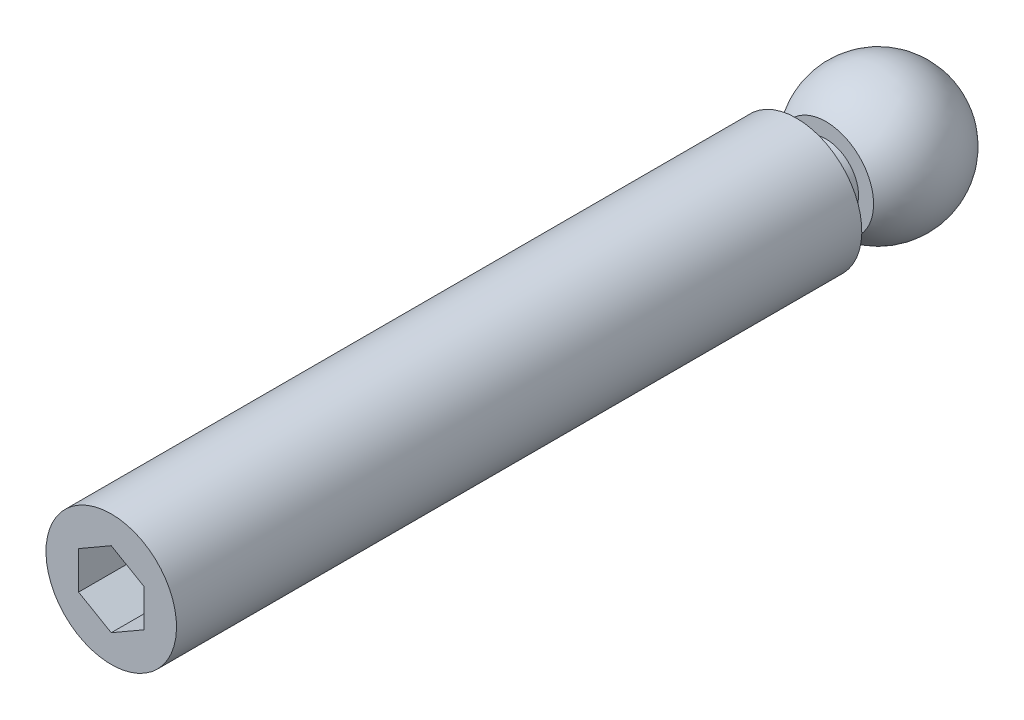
ISO-10303-21;
HEADER;
FILE_DESCRIPTION(('STEP AP214'),'2;1');
FILE_NAME('part.step','',(''),(''),'','','');
FILE_SCHEMA(('AUTOMOTIVE_DESIGN { 1 0 10303 214 1 1 1 1 }'));
ENDSEC;
DATA;
#1=APPLICATION_CONTEXT('core data for automotive mechanical design processes');
#2=APPLICATION_PROTOCOL_DEFINITION('international standard','automotive_design',2000,#1);
#3=PRODUCT_CONTEXT('',#1,'mechanical');
#4=PRODUCT('Part','Part','',(#3));
#5=PRODUCT_RELATED_PRODUCT_CATEGORY('part','',(#4));
#6=PRODUCT_DEFINITION_FORMATION('','',#4);
#7=PRODUCT_DEFINITION_CONTEXT('part definition',#1,'design');
#8=PRODUCT_DEFINITION('design','',#6,#7);
#9=PRODUCT_DEFINITION_SHAPE('','',#8);
#10=(LENGTH_UNIT() NAMED_UNIT(*) SI_UNIT(.MILLI.,.METRE.));
#11=(NAMED_UNIT(*) PLANE_ANGLE_UNIT() SI_UNIT($,.RADIAN.));
#12=(NAMED_UNIT(*) SI_UNIT($,.STERADIAN.) SOLID_ANGLE_UNIT());
#13=UNCERTAINTY_MEASURE_WITH_UNIT(LENGTH_MEASURE(1.E-05),#10,'distance_accuracy_value','');
#14=(GEOMETRIC_REPRESENTATION_CONTEXT(3) GLOBAL_UNCERTAINTY_ASSIGNED_CONTEXT((#13)) GLOBAL_UNIT_ASSIGNED_CONTEXT((#10,
#11,#12)) REPRESENTATION_CONTEXT('',''));
#15=CARTESIAN_POINT('',(0.,0.,0.));
#16=DIRECTION('',(0.,0.,1.));
#17=DIRECTION('',(1.,0.,0.));
#18=AXIS2_PLACEMENT_3D('',#15,#16,#17);
#19=CARTESIAN_POINT('',(0.,0.,6.5));
#20=DIRECTION('',(0.,-1.,0.));
#21=DIRECTION('',(-1.,0.,0.));
#22=AXIS2_PLACEMENT_3D('',#19,#20,#21);
#23=SPHERICAL_SURFACE('',#22,6.5);
#24=CARTESIAN_POINT('',(0.,0.,6.5));
#25=DIRECTION('',(0.,0.,1.));
#26=DIRECTION('',(0.,1.,0.));
#27=AXIS2_PLACEMENT_3D('',#24,#25,#26);
#28=SPHERICAL_SURFACE('',#27,6.5);
#29=CARTESIAN_POINT('',(0.,0.,11.3));
#30=DIRECTION('',(0.,0.,1.));
#31=DIRECTION('',(0.,1.,0.));
#32=AXIS2_PLACEMENT_3D('',#29,#30,#31);
#33=CIRCLE('',#32,4.38292140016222);
#34=CARTESIAN_POINT('',(0.,4.38292140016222,11.3));
#35=VERTEX_POINT('',#34);
#36=EDGE_CURVE('E9',#35,#35,#33,.T.);
#37=ORIENTED_EDGE('',*,*,#36,.F.);
#38=EDGE_LOOP('',(#37));
#39=FACE_BOUND('',#38,.T.);
#40=ADVANCED_FACE('F14',(#39),#28,.T.);
#41=CARTESIAN_POINT('',(0.,-4.38292140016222,11.3));
#42=DIRECTION('',(0.,0.,-1.));
#43=DIRECTION('',(0.,-1.,0.));
#44=AXIS2_PLACEMENT_3D('',#41,#42,#43);
#45=PLANE('',#44);
#46=CARTESIAN_POINT('',(0.,0.,11.3));
#47=DIRECTION('',(0.,0.,1.));
#48=DIRECTION('',(0.,1.,0.));
#49=AXIS2_PLACEMENT_3D('',#46,#47,#48);
#50=CIRCLE('',#49,3.);
#51=CARTESIAN_POINT('',(0.,3.,11.3));
#52=VERTEX_POINT('',#51);
#53=EDGE_CURVE('E21',#52,#52,#50,.T.);
#54=ORIENTED_EDGE('',*,*,#53,.F.);
#55=EDGE_LOOP('',(#54));
#56=FACE_BOUND('',#55,.T.);
#57=ORIENTED_EDGE('',*,*,#36,.T.);
#58=EDGE_LOOP('',(#57));
#59=FACE_BOUND('',#58,.T.);
#60=ADVANCED_FACE('F134',(#56,#59),#45,.F.);
#61=CARTESIAN_POINT('',(0.,0.,8.3));
#62=DIRECTION('',(0.,0.,1.));
#63=DIRECTION('',(0.,1.,0.));
#64=AXIS2_PLACEMENT_3D('',#61,#62,#63);
#65=CYLINDRICAL_SURFACE('',#64,3.);
#66=ORIENTED_EDGE('',*,*,#53,.T.);
#67=EDGE_LOOP('',(#66));
#68=FACE_BOUND('',#67,.T.);
#69=CARTESIAN_POINT('',(0.,0.,14.));
#70=DIRECTION('',(0.,0.,1.));
#71=DIRECTION('',(0.,1.,0.));
#72=AXIS2_PLACEMENT_3D('',#69,#70,#71);
#73=CIRCLE('',#72,3.);
#74=CARTESIAN_POINT('',(0.,3.,14.));
#75=VERTEX_POINT('',#74);
#76=EDGE_CURVE('E126',#75,#75,#73,.T.);
#77=ORIENTED_EDGE('',*,*,#76,.F.);
#78=EDGE_LOOP('',(#77));
#79=FACE_BOUND('',#78,.T.);
#80=ADVANCED_FACE('F131',(#68,#79),#65,.T.);
#81=CARTESIAN_POINT('',(0.,-6.,14.));
#82=DIRECTION('',(0.,0.,-1.));
#83=DIRECTION('',(0.,-1.,0.));
#84=AXIS2_PLACEMENT_3D('',#81,#82,#83);
#85=PLANE('',#84);
#86=ORIENTED_EDGE('',*,*,#76,.T.);
#87=EDGE_LOOP('',(#86));
#88=FACE_BOUND('',#87,.T.);
#89=CARTESIAN_POINT('',(0.,0.,14.));
#90=DIRECTION('',(0.,0.,1.));
#91=DIRECTION('',(0.,1.,0.));
#92=AXIS2_PLACEMENT_3D('',#89,#90,#91);
#93=CIRCLE('',#92,6.);
#94=CARTESIAN_POINT('',(0.,6.,14.));
#95=VERTEX_POINT('',#94);
#96=EDGE_CURVE('E123',#95,#95,#93,.T.);
#97=ORIENTED_EDGE('',*,*,#96,.F.);
#98=EDGE_LOOP('',(#97));
#99=FACE_BOUND('',#98,.T.);
#100=ADVANCED_FACE('F157',(#88,#99),#85,.T.);
#101=CARTESIAN_POINT('',(0.,0.,8.3));
#102=DIRECTION('',(0.,0.,1.));
#103=DIRECTION('',(0.,1.,0.));
#104=AXIS2_PLACEMENT_3D('',#101,#102,#103);
#105=CYLINDRICAL_SURFACE('',#104,6.);
#106=ORIENTED_EDGE('',*,*,#96,.T.);
#107=EDGE_LOOP('',(#106));
#108=FACE_BOUND('',#107,.T.);
#109=CARTESIAN_POINT('',(0.,0.,77.));
#110=DIRECTION('',(0.,0.,1.));
#111=DIRECTION('',(0.,1.,0.));
#112=AXIS2_PLACEMENT_3D('',#109,#110,#111);
#113=CIRCLE('',#112,6.);
#114=CARTESIAN_POINT('',(0.,6.,77.));
#115=VERTEX_POINT('',#114);
#116=EDGE_CURVE('E115',#115,#115,#113,.T.);
#117=ORIENTED_EDGE('',*,*,#116,.F.);
#118=EDGE_LOOP('',(#117));
#119=FACE_BOUND('',#118,.T.);
#120=ADVANCED_FACE('F165',(#108,#119),#105,.T.);
#121=CARTESIAN_POINT('',(0.,0.,77.));
#122=DIRECTION('',(0.,0.,1.));
#123=DIRECTION('',(0.,1.,0.));
#124=AXIS2_PLACEMENT_3D('',#121,#122,#123);
#125=PLANE('',#124);
#126=DIRECTION('',(-0.866025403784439,0.5,0.));
#127=VECTOR('',#126,1.);
#128=CARTESIAN_POINT('',(3.,1.73205080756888,77.));
#129=LINE('',#128,#127);
#130=CARTESIAN_POINT('',(3.,1.73205080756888,77.));
#131=VERTEX_POINT('',#130);
#132=CARTESIAN_POINT('',(0.,3.46410161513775,77.));
#133=VERTEX_POINT('',#132);
#134=EDGE_CURVE('E28',#131,#133,#129,.T.);
#135=ORIENTED_EDGE('',*,*,#134,.F.);
#136=DIRECTION('',(0.,1.,0.));
#137=VECTOR('',#136,1.);
#138=CARTESIAN_POINT('',(3.,-1.73205080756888,77.));
#139=LINE('',#138,#137);
#140=CARTESIAN_POINT('',(3.,-1.73205080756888,77.));
#141=VERTEX_POINT('',#140);
#142=EDGE_CURVE('E111',#141,#131,#139,.T.);
#143=ORIENTED_EDGE('',*,*,#142,.F.);
#144=DIRECTION('',(0.866025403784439,0.5,0.));
#145=VECTOR('',#144,1.);
#146=CARTESIAN_POINT('',(0.,-3.46410161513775,77.));
#147=LINE('',#146,#145);
#148=CARTESIAN_POINT('',(0.,-3.46410161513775,77.));
#149=VERTEX_POINT('',#148);
#150=EDGE_CURVE('E109',#149,#141,#147,.T.);
#151=ORIENTED_EDGE('',*,*,#150,.F.);
#152=DIRECTION('',(0.866025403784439,-0.5,0.));
#153=VECTOR('',#152,1.);
#154=CARTESIAN_POINT('',(-3.,-1.73205080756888,77.));
#155=LINE('',#154,#153);
#156=CARTESIAN_POINT('',(-3.,-1.73205080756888,77.));
#157=VERTEX_POINT('',#156);
#158=EDGE_CURVE('E76',#157,#149,#155,.T.);
#159=ORIENTED_EDGE('',*,*,#158,.F.);
#160=DIRECTION('',(0.,-1.,0.));
#161=VECTOR('',#160,1.);
#162=CARTESIAN_POINT('',(-3.,1.73205080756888,77.));
#163=LINE('',#162,#161);
#164=CARTESIAN_POINT('',(-3.,1.73205080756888,77.));
#165=VERTEX_POINT('',#164);
#166=EDGE_CURVE('E105',#165,#157,#163,.T.);
#167=ORIENTED_EDGE('',*,*,#166,.F.);
#168=DIRECTION('',(-0.866025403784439,-0.5,0.));
#169=VECTOR('',#168,1.);
#170=CARTESIAN_POINT('',(0.,3.46410161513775,77.));
#171=LINE('',#170,#169);
#172=EDGE_CURVE('E102',#133,#165,#171,.T.);
#173=ORIENTED_EDGE('',*,*,#172,.F.);
#174=EDGE_LOOP('',(#135,#143,#151,#159,#167,#173));
#175=FACE_BOUND('',#174,.T.);
#176=ORIENTED_EDGE('',*,*,#116,.T.);
#177=EDGE_LOOP('',(#176));
#178=FACE_BOUND('',#177,.T.);
#179=ADVANCED_FACE('F174',(#175,#178),#125,.T.);
#180=CARTESIAN_POINT('',(3.,1.73205080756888,69.));
#181=DIRECTION('',(0.5,0.866025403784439,0.));
#182=DIRECTION('',(-0.866025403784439,0.5,0.));
#183=AXIS2_PLACEMENT_3D('',#180,#181,#182);
#184=PLANE('',#183);
#185=ORIENTED_EDGE('',*,*,#134,.T.);
#186=DIRECTION('',(0.,0.,1.));
#187=VECTOR('',#186,1.);
#188=CARTESIAN_POINT('',(0.,3.46410161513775,69.));
#189=LINE('',#188,#187);
#190=CARTESIAN_POINT('',(0.,3.46410161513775,69.));
#191=VERTEX_POINT('',#190);
#192=EDGE_CURVE('E58',#191,#133,#189,.T.);
#193=ORIENTED_EDGE('',*,*,#192,.F.);
#194=DIRECTION('',(-0.866025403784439,0.5,0.));
#195=VECTOR('',#194,1.);
#196=CARTESIAN_POINT('',(3.,1.73205080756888,69.));
#197=LINE('',#196,#195);
#198=CARTESIAN_POINT('',(3.,1.73205080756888,69.));
#199=VERTEX_POINT('',#198);
#200=EDGE_CURVE('E113',#199,#191,#197,.T.);
#201=ORIENTED_EDGE('',*,*,#200,.F.);
#202=DIRECTION('',(0.,0.,1.));
#203=VECTOR('',#202,1.);
#204=CARTESIAN_POINT('',(3.,1.73205080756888,69.));
#205=LINE('',#204,#203);
#206=EDGE_CURVE('E36',#199,#131,#205,.T.);
#207=ORIENTED_EDGE('',*,*,#206,.T.);
#208=EDGE_LOOP('',(#185,#193,#201,#207));
#209=FACE_BOUND('',#208,.T.);
#210=ADVANCED_FACE('F183',(#209),#184,.F.);
#211=CARTESIAN_POINT('',(3.,-1.73205080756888,69.));
#212=DIRECTION('',(1.,0.,0.));
#213=DIRECTION('',(0.,0.,-1.));
#214=AXIS2_PLACEMENT_3D('',#211,#212,#213);
#215=PLANE('',#214);
#216=ORIENTED_EDGE('',*,*,#142,.T.);
#217=ORIENTED_EDGE('',*,*,#206,.F.);
#218=DIRECTION('',(0.,1.,0.));
#219=VECTOR('',#218,1.);
#220=CARTESIAN_POINT('',(3.,-1.73205080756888,69.));
#221=LINE('',#220,#219);
#222=CARTESIAN_POINT('',(3.,-1.73205080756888,69.));
#223=VERTEX_POINT('',#222);
#224=EDGE_CURVE('E88',#223,#199,#221,.T.);
#225=ORIENTED_EDGE('',*,*,#224,.F.);
#226=DIRECTION('',(0.,0.,1.));
#227=VECTOR('',#226,1.);
#228=CARTESIAN_POINT('',(3.,-1.73205080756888,69.));
#229=LINE('',#228,#227);
#230=EDGE_CURVE('E80',#223,#141,#229,.T.);
#231=ORIENTED_EDGE('',*,*,#230,.T.);
#232=EDGE_LOOP('',(#216,#217,#225,#231));
#233=FACE_BOUND('',#232,.T.);
#234=ADVANCED_FACE('F192',(#233),#215,.F.);
#235=CARTESIAN_POINT('',(0.,-3.46410161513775,69.));
#236=DIRECTION('',(0.5,-0.866025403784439,0.));
#237=DIRECTION('',(0.866025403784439,0.5,0.));
#238=AXIS2_PLACEMENT_3D('',#235,#236,#237);
#239=PLANE('',#238);
#240=ORIENTED_EDGE('',*,*,#150,.T.);
#241=ORIENTED_EDGE('',*,*,#230,.F.);
#242=DIRECTION('',(0.866025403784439,0.5,0.));
#243=VECTOR('',#242,1.);
#244=CARTESIAN_POINT('',(0.,-3.46410161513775,69.));
#245=LINE('',#244,#243);
#246=CARTESIAN_POINT('',(0.,-3.46410161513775,69.));
#247=VERTEX_POINT('',#246);
#248=EDGE_CURVE('E84',#247,#223,#245,.T.);
#249=ORIENTED_EDGE('',*,*,#248,.F.);
#250=DIRECTION('',(0.,0.,1.));
#251=VECTOR('',#250,1.);
#252=CARTESIAN_POINT('',(0.,-3.46410161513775,69.));
#253=LINE('',#252,#251);
#254=EDGE_CURVE('E69',#247,#149,#253,.T.);
#255=ORIENTED_EDGE('',*,*,#254,.T.);
#256=EDGE_LOOP('',(#240,#241,#249,#255));
#257=FACE_BOUND('',#256,.T.);
#258=ADVANCED_FACE('F85',(#257),#239,.F.);
#259=CARTESIAN_POINT('',(-3.,-1.73205080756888,69.));
#260=DIRECTION('',(-0.5,-0.866025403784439,0.));
#261=DIRECTION('',(0.866025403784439,-0.5,0.));
#262=AXIS2_PLACEMENT_3D('',#259,#260,#261);
#263=PLANE('',#262);
#264=ORIENTED_EDGE('',*,*,#158,.T.);
#265=ORIENTED_EDGE('',*,*,#254,.F.);
#266=DIRECTION('',(0.866025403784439,-0.5,0.));
#267=VECTOR('',#266,1.);
#268=CARTESIAN_POINT('',(-3.,-1.73205080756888,69.));
#269=LINE('',#268,#267);
#270=CARTESIAN_POINT('',(-3.,-1.73205080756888,69.));
#271=VERTEX_POINT('',#270);
#272=EDGE_CURVE('E73',#271,#247,#269,.T.);
#273=ORIENTED_EDGE('',*,*,#272,.F.);
#274=DIRECTION('',(0.,0.,1.));
#275=VECTOR('',#274,1.);
#276=CARTESIAN_POINT('',(-3.,-1.73205080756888,69.));
#277=LINE('',#276,#275);
#278=EDGE_CURVE('E81',#271,#157,#277,.T.);
#279=ORIENTED_EDGE('',*,*,#278,.T.);
#280=EDGE_LOOP('',(#264,#265,#273,#279));
#281=FACE_BOUND('',#280,.T.);
#282=ADVANCED_FACE('F71',(#281),#263,.F.);
#283=CARTESIAN_POINT('',(-3.,1.73205080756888,69.));
#284=DIRECTION('',(-1.,0.,0.));
#285=DIRECTION('',(0.,-1.,0.));
#286=AXIS2_PLACEMENT_3D('',#283,#284,#285);
#287=PLANE('',#286);
#288=ORIENTED_EDGE('',*,*,#166,.T.);
#289=ORIENTED_EDGE('',*,*,#278,.F.);
#290=DIRECTION('',(0.,-1.,0.));
#291=VECTOR('',#290,1.);
#292=CARTESIAN_POINT('',(-3.,1.73205080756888,69.));
#293=LINE('',#292,#291);
#294=CARTESIAN_POINT('',(-3.,1.73205080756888,69.));
#295=VERTEX_POINT('',#294);
#296=EDGE_CURVE('E94',#295,#271,#293,.T.);
#297=ORIENTED_EDGE('',*,*,#296,.F.);
#298=DIRECTION('',(0.,0.,1.));
#299=VECTOR('',#298,1.);
#300=CARTESIAN_POINT('',(-3.,1.73205080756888,69.));
#301=LINE('',#300,#299);
#302=EDGE_CURVE('E118',#295,#165,#301,.T.);
#303=ORIENTED_EDGE('',*,*,#302,.T.);
#304=EDGE_LOOP('',(#288,#289,#297,#303));
#305=FACE_BOUND('',#304,.T.);
#306=ADVANCED_FACE('F214',(#305),#287,.F.);
#307=CARTESIAN_POINT('',(0.,3.46410161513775,69.));
#308=DIRECTION('',(-0.5,0.866025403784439,0.));
#309=DIRECTION('',(-0.866025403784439,-0.5,0.));
#310=AXIS2_PLACEMENT_3D('',#307,#308,#309);
#311=PLANE('',#310);
#312=ORIENTED_EDGE('',*,*,#172,.T.);
#313=ORIENTED_EDGE('',*,*,#302,.F.);
#314=DIRECTION('',(-0.866025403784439,-0.5,0.));
#315=VECTOR('',#314,1.);
#316=CARTESIAN_POINT('',(0.,3.46410161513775,69.));
#317=LINE('',#316,#315);
#318=EDGE_CURVE('E96',#191,#295,#317,.T.);
#319=ORIENTED_EDGE('',*,*,#318,.F.);
#320=ORIENTED_EDGE('',*,*,#192,.T.);
#321=EDGE_LOOP('',(#312,#313,#319,#320));
#322=FACE_BOUND('',#321,.T.);
#323=ADVANCED_FACE('F222',(#322),#311,.F.);
#324=CARTESIAN_POINT('',(0.,3.46410161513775,69.));
#325=DIRECTION('',(0.,0.,1.));
#326=DIRECTION('',(1.,0.,0.));
#327=AXIS2_PLACEMENT_3D('',#324,#325,#326);
#328=PLANE('',#327);
#329=ORIENTED_EDGE('',*,*,#200,.T.);
#330=ORIENTED_EDGE('',*,*,#318,.T.);
#331=ORIENTED_EDGE('',*,*,#296,.T.);
#332=ORIENTED_EDGE('',*,*,#272,.T.);
#333=ORIENTED_EDGE('',*,*,#248,.T.);
#334=ORIENTED_EDGE('',*,*,#224,.T.);
#335=EDGE_LOOP('',(#329,#330,#331,#332,#333,#334));
#336=FACE_BOUND('',#335,.T.);
#337=ADVANCED_FACE('F91',(#336),#328,.T.);
#338=CLOSED_SHELL('',(#40,#60,#80,#100,#120,#179,#210,#234,#258,#282,#306,#323,#337));
#339=MANIFOLD_SOLID_BREP('B1',#338);
#340=ADVANCED_BREP_SHAPE_REPRESENTATION('',(#18,#339),#14);
#341=SHAPE_DEFINITION_REPRESENTATION(#9,#340);
ENDSEC;
END-ISO-10303-21;
